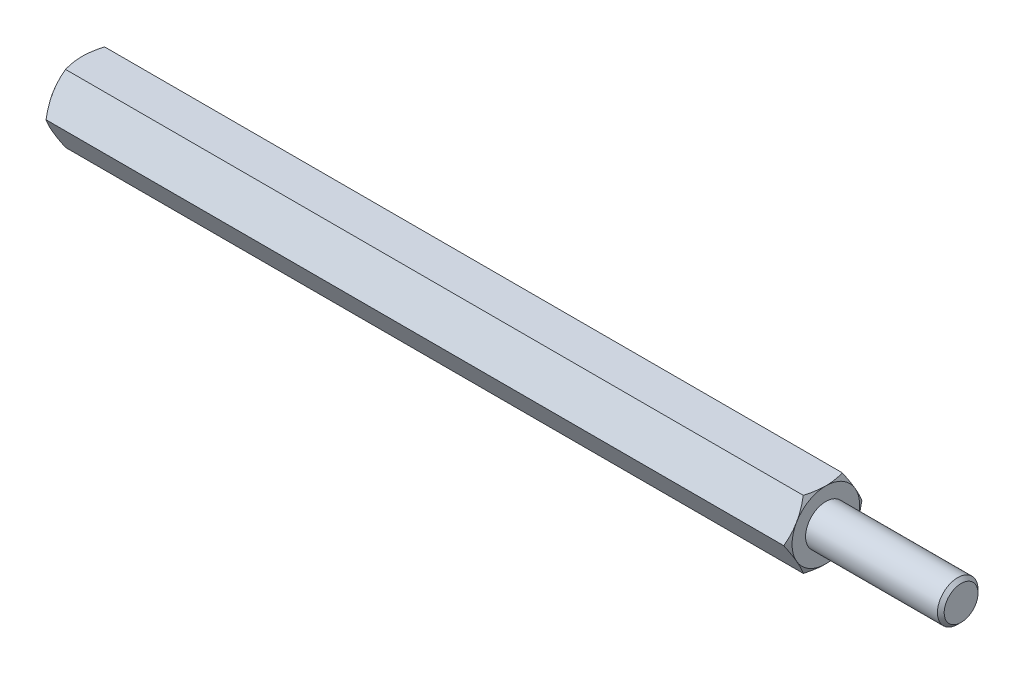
from build123d import *

# Parameters (mm, degrees)
EXTRUDE2_DEPTH = 27.5
SKETCH3_R      = 1.25
EXTRUDE3_DEPTH = 10
SKETCH5_R      = 1.5
EXTRUDE4_DEPTH = 10
CHAMFER1_SIZE  = 0.25


with BuildPart() as part:
    # Sketch1 → Extrude2 (new, symmetric)
    with BuildSketch(Plane(origin=(0, 0, 0), x_dir=(0, 0, -1), z_dir=(1, 0, 0))):
        Polygon((1.443375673, 2.5), (-1.443375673, 2.5), (-2.886751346, 0), (-1.443375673, -2.5), (1.443375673, -2.5), (2.886751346, 0), align=None)
    extrude(amount=EXTRUDE2_DEPTH, both=True)

    # Sketch2 → Cut-Revolve1 (revolve, cut)
    with BuildSketch(Plane.XY):
        with BuildLine():
            Line((-27.5, 2.5), (-26, 5.098076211))
            ThreePointArc((-26, 5.098076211), (-26.48810136, 6.276457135), (-27.5, 5.5))
            Line((-27.5, 5.5), (-27.5, 2.5))
        make_face()
    cut_revolve1 = revolve(axis=Axis((0, 0, 0), (1, 0, 0)), mode=Mode.SUBTRACT)

    # Mirror1: Cut-Revolve1 across plane
    add(cut_revolve1.mirror(Plane(origin=(0, 0, 0), x_dir=(0, 0, 1), z_dir=(1, 0, 0))), mode=Mode.SUBTRACT)

    # Sketch3 → Extrude3 (cut)
    with BuildSketch(Plane.ZY.offset(27.5)):
        Circle(SKETCH3_R)
    extrude(amount=-EXTRUDE3_DEPTH, mode=Mode.SUBTRACT)

    # Sketch4 → Cut-Revolve2 (revolve, cut)
    with BuildSketch(Plane.XY, mode=Mode.PRIVATE) as cut_revolve2_sk:
        Polygon((-17.5, 0), (-17.5, 1.25), (-16.778312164, 0), align=None)
    revolve(cut_revolve2_sk.sketch.rotate(Axis((-16.778312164, 0, 0), (-1, 0, 0)), 270), axis=Axis((-16.778312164, 0, 0), (-1, 0, 0)), mode=Mode.SUBTRACT)

    # Sketch5 → Extrude4 (add)
    with BuildSketch(Plane(origin=(27.5, 0, 0), x_dir=(0, 0, -1), z_dir=(1, 0, 0))):
        Circle(SKETCH5_R)
    extrude(amount=EXTRUDE4_DEPTH)

    # Chamfer1
    chamfer1_edges = [part.edges().sort_by_distance(p)[0] for p in [
        (37.5, 0, 1.5),
    ]]
    chamfer(chamfer1_edges, length=CHAMFER1_SIZE)


solid = part.part
